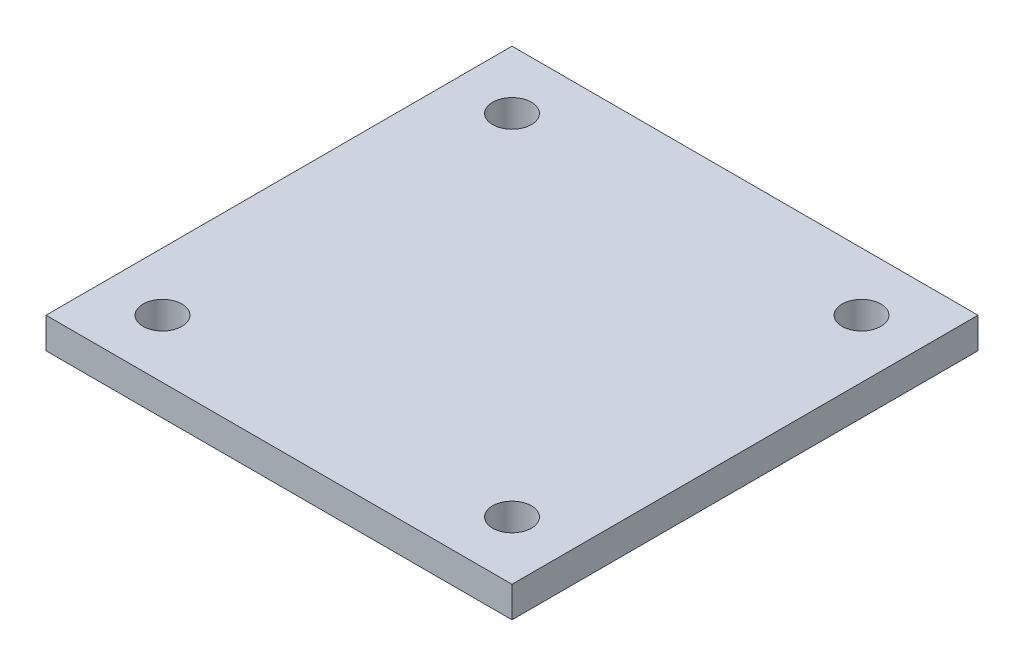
from build123d import *

# Parameters (mm, degrees)
ESQUISSE1_W        = 24
ESQUISSE1_H        = 24
ESQUISSE1_R        = 1
BOSS_EXTRU_1_DEPTH = 1.5875


with BuildPart() as part:
    # Esquisse1 → Boss.-Extru.1 (new body)
    with BuildSketch(Plane(origin=(0, 0, 0), x_dir=(1, 0, 0), z_dir=(0, 1, 0))):
        Rectangle(ESQUISSE1_W, ESQUISSE1_H)
        with Locations(Location((-9, 9, 0), (0, 0, 270))):
            Circle(ESQUISSE1_R, mode=Mode.SUBTRACT)
        with Locations(Location((9, 9, 0), (0, 0, 270))):
            Circle(ESQUISSE1_R, mode=Mode.SUBTRACT)
        with Locations(Location((-9, -9, 0), (0, 0, 270))):
            Circle(ESQUISSE1_R, mode=Mode.SUBTRACT)
        with Locations(Location((9, -9, 0), (0, 0, 270))):
            Circle(ESQUISSE1_R, mode=Mode.SUBTRACT)
    extrude(amount=BOSS_EXTRU_1_DEPTH)


solid = part.part
